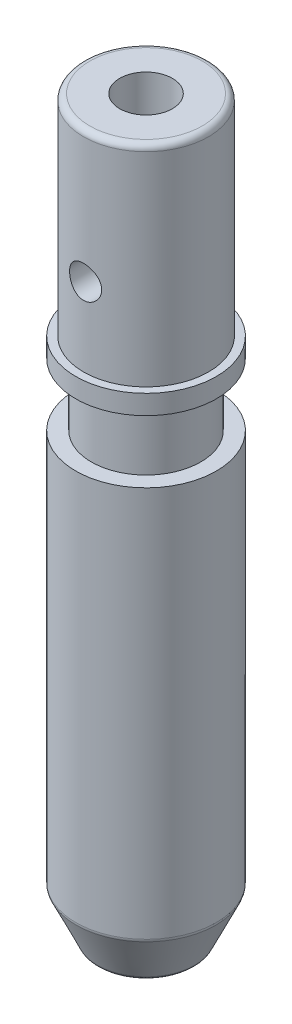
ISO-10303-21;
HEADER;
FILE_DESCRIPTION(('STEP AP214'),'2;1');
FILE_NAME('part.step','',(''),(''),'','','');
FILE_SCHEMA(('AUTOMOTIVE_DESIGN { 1 0 10303 214 1 1 1 1 }'));
ENDSEC;
DATA;
#1=APPLICATION_CONTEXT('core data for automotive mechanical design processes');
#2=APPLICATION_PROTOCOL_DEFINITION('international standard','automotive_design',2000,#1);
#3=PRODUCT_CONTEXT('',#1,'mechanical');
#4=PRODUCT('Part','Part','',(#3));
#5=PRODUCT_RELATED_PRODUCT_CATEGORY('part','',(#4));
#6=PRODUCT_DEFINITION_FORMATION('','',#4);
#7=PRODUCT_DEFINITION_CONTEXT('part definition',#1,'design');
#8=PRODUCT_DEFINITION('design','',#6,#7);
#9=PRODUCT_DEFINITION_SHAPE('','',#8);
#10=(LENGTH_UNIT() NAMED_UNIT(*) SI_UNIT(.MILLI.,.METRE.));
#11=(NAMED_UNIT(*) PLANE_ANGLE_UNIT() SI_UNIT($,.RADIAN.));
#12=(NAMED_UNIT(*) SI_UNIT($,.STERADIAN.) SOLID_ANGLE_UNIT());
#13=UNCERTAINTY_MEASURE_WITH_UNIT(LENGTH_MEASURE(1.E-05),#10,'distance_accuracy_value','');
#14=(GEOMETRIC_REPRESENTATION_CONTEXT(3) GLOBAL_UNCERTAINTY_ASSIGNED_CONTEXT((#13)) GLOBAL_UNIT_ASSIGNED_CONTEXT((#10,
#11,#12)) REPRESENTATION_CONTEXT('',''));
#15=CARTESIAN_POINT('',(0.,0.,0.));
#16=DIRECTION('',(0.,0.,1.));
#17=DIRECTION('',(1.,0.,0.));
#18=AXIS2_PLACEMENT_3D('',#15,#16,#17);
#19=CARTESIAN_POINT('',(0.,-46.609,0.));
#20=DIRECTION('',(0.,-1.,0.));
#21=DIRECTION('',(0.,0.,-1.));
#22=AXIS2_PLACEMENT_3D('',#19,#20,#21);
#23=PLANE('',#22);
#24=CARTESIAN_POINT('',(0.,-46.609,0.));
#25=DIRECTION('',(0.,-1.,0.));
#26=DIRECTION('',(0.,0.,-1.));
#27=AXIS2_PLACEMENT_3D('',#24,#25,#26);
#28=CIRCLE('',#27,14.2875);
#29=CARTESIAN_POINT('',(0.,-46.609,-14.2875));
#30=VERTEX_POINT('',#29);
#31=EDGE_CURVE('E76',#30,#30,#28,.T.);
#32=ORIENTED_EDGE('',*,*,#31,.T.);
#33=EDGE_LOOP('',(#32));
#34=FACE_BOUND('',#33,.T.);
#35=CARTESIAN_POINT('',(0.,-46.609,0.));
#36=DIRECTION('',(0.,-1.,0.));
#37=DIRECTION('',(0.,0.,-1.));
#38=AXIS2_PLACEMENT_3D('',#35,#36,#37);
#39=CIRCLE('',#38,11.1125);
#40=CARTESIAN_POINT('',(0.,-46.609,-11.1125));
#41=VERTEX_POINT('',#40);
#42=EDGE_CURVE('E63',#41,#41,#39,.T.);
#43=ORIENTED_EDGE('',*,*,#42,.F.);
#44=EDGE_LOOP('',(#43));
#45=FACE_BOUND('',#44,.T.);
#46=ADVANCED_FACE('F39',(#34,#45),#23,.T.);
#47=CARTESIAN_POINT('',(0.,-42.672,0.));
#48=DIRECTION('',(0.,1.,0.));
#49=DIRECTION('',(0.,0.,1.));
#50=AXIS2_PLACEMENT_3D('',#47,#48,#49);
#51=CYLINDRICAL_SURFACE('',#50,12.7);
#52=CARTESIAN_POINT('',(0.,-1.27,0.));
#53=DIRECTION('',(0.,1.,0.));
#54=DIRECTION('',(0.,0.,1.));
#55=AXIS2_PLACEMENT_3D('',#52,#53,#54);
#56=CIRCLE('',#55,12.7);
#57=CARTESIAN_POINT('',(0.,-1.27,12.7));
#58=VERTEX_POINT('',#57);
#59=EDGE_CURVE('E188',#58,#58,#56,.F.);
#60=ORIENTED_EDGE('',*,*,#59,.T.);
#61=EDGE_LOOP('',(#60));
#62=FACE_BOUND('',#61,.T.);
#63=CARTESIAN_POINT('',(0.,-30.0609,12.7));
#64=CARTESIAN_POINT('',(0.180166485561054,-30.0608952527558,12.6999970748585));
#65=CARTESIAN_POINT('',(0.360385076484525,-30.0459321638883,12.6961281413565));
#66=CARTESIAN_POINT('',(0.715646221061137,-29.9865715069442,12.6810694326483));
#67=CARTESIAN_POINT('',(0.890685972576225,-29.9421582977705,12.6698757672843));
#68=CARTESIAN_POINT('',(1.23040876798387,-29.825424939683,12.6414054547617));
#69=CARTESIAN_POINT('',(1.39510433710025,-29.7531393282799,12.6241363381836));
#70=CARTESIAN_POINT('',(1.71003287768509,-29.5828373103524,12.5853484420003));
#71=CARTESIAN_POINT('',(1.86026516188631,-29.4848196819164,12.5638294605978));
#72=CARTESIAN_POINT('',(2.14525801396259,-29.2635928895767,12.5183513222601));
#73=CARTESIAN_POINT('',(2.27966051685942,-29.1399305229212,12.494352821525));
#74=CARTESIAN_POINT('',(2.52606492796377,-28.8718942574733,12.4468781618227));
#75=CARTESIAN_POINT('',(2.63806416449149,-28.7275178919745,12.4234020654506));
#76=CARTESIAN_POINT('',(2.83819226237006,-28.4193396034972,12.37923124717));
#77=CARTESIAN_POINT('',(2.92591588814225,-28.2552667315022,12.3585863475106));
#78=CARTESIAN_POINT('',(3.07239491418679,-27.9140857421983,12.322991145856));
#79=CARTESIAN_POINT('',(3.13115523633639,-27.7369798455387,12.3080398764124));
#80=CARTESIAN_POINT('',(3.2168090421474,-27.3787092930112,12.2859299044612));
#81=CARTESIAN_POINT('',(3.24434857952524,-27.1977090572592,12.2786134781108));
#82=CARTESIAN_POINT('',(3.26879218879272,-26.8335210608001,12.272129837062));
#83=CARTESIAN_POINT('',(3.26570154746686,-26.6503336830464,12.272961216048));
#84=CARTESIAN_POINT('',(3.22948693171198,-26.291960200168,12.2825377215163));
#85=CARTESIAN_POINT('',(3.19713767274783,-26.1166894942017,12.2910787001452));
#86=CARTESIAN_POINT('',(3.10456198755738,-25.7741504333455,12.3147860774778));
#87=CARTESIAN_POINT('',(3.04433347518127,-25.6068826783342,12.3299529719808));
#88=CARTESIAN_POINT('',(2.89706074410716,-25.2830442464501,12.3653873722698));
#89=CARTESIAN_POINT('',(2.80973932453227,-25.1266055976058,12.3857071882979));
#90=CARTESIAN_POINT('',(2.61095317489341,-24.8303261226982,12.4291289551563));
#91=CARTESIAN_POINT('',(2.49948400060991,-24.690488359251,12.4522314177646));
#92=CARTESIAN_POINT('',(2.25157494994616,-24.4269459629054,12.4994709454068));
#93=CARTESIAN_POINT('',(2.11448261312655,-24.3038561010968,12.5236181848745));
#94=CARTESIAN_POINT('',(1.82130992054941,-24.0822930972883,12.569598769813));
#95=CARTESIAN_POINT('',(1.66522891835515,-23.9838207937,12.5914320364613));
#96=CARTESIAN_POINT('',(1.33760144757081,-23.8140440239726,12.6304435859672));
#97=CARTESIAN_POINT('',(1.16599851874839,-23.7428441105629,12.6476038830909));
#98=CARTESIAN_POINT('',(0.81271866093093,-23.6304765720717,12.6752055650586));
#99=CARTESIAN_POINT('',(0.63104377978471,-23.5893028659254,12.6856483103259));
#100=CARTESIAN_POINT('',(0.268029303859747,-23.5391062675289,12.698435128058));
#101=CARTESIAN_POINT('',(0.0868126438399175,-23.5292467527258,12.7009898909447));
#102=CARTESIAN_POINT('',(-0.274682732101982,-23.5396572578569,12.6983153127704));
#103=CARTESIAN_POINT('',(-0.454961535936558,-23.5599244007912,12.6930867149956));
#104=CARTESIAN_POINT('',(-0.80652399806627,-23.6293246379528,12.6755683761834));
#105=CARTESIAN_POINT('',(-0.977904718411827,-23.6779970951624,12.6633913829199));
#106=CARTESIAN_POINT('',(-1.31005673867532,-23.8022965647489,12.6333521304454));
#107=CARTESIAN_POINT('',(-1.47082693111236,-23.877926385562,12.6154892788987));
#108=CARTESIAN_POINT('',(-1.78049080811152,-24.0555863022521,12.5755595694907));
#109=CARTESIAN_POINT('',(-1.92910936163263,-24.158079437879,12.5534209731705));
#110=CARTESIAN_POINT('',(-2.20733354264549,-24.3859687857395,12.5075015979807));
#111=CARTESIAN_POINT('',(-2.33693568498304,-24.511369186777,12.4837205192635));
#112=CARTESIAN_POINT('',(-2.57692815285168,-24.785406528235,12.4364310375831));
#113=CARTESIAN_POINT('',(-2.68673012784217,-24.9345636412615,12.4129458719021));
#114=CARTESIAN_POINT('',(-2.8797504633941,-25.24967585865,12.3695942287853));
#115=CARTESIAN_POINT('',(-2.96296998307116,-25.4156302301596,12.3497275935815));
#116=CARTESIAN_POINT('',(-3.09983842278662,-25.7587564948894,12.3160858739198));
#117=CARTESIAN_POINT('',(-3.15366170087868,-25.9358551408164,12.3022749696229));
#118=CARTESIAN_POINT('',(-3.23065172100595,-26.2970001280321,12.2822840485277));
#119=CARTESIAN_POINT('',(-3.25382562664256,-26.4810448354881,12.2761022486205));
#120=CARTESIAN_POINT('',(-3.26846895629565,-26.8448557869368,12.2722108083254));
#121=CARTESIAN_POINT('',(-3.26088085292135,-27.0245819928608,12.2742493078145));
#122=CARTESIAN_POINT('',(-3.21638462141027,-27.3800997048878,12.2859834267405));
#123=CARTESIAN_POINT('',(-3.17947714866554,-27.5558912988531,12.2956788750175));
#124=CARTESIAN_POINT('',(-3.07791790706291,-27.8974583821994,12.3214900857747));
#125=CARTESIAN_POINT('',(-3.01345238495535,-28.0632927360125,12.3375626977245));
#126=CARTESIAN_POINT('',(-2.85875297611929,-28.381913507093,12.3743211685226));
#127=CARTESIAN_POINT('',(-2.76851531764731,-28.5346980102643,12.3950077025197));
#128=CARTESIAN_POINT('',(-2.56191914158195,-28.8274135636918,12.4393732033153));
#129=CARTESIAN_POINT('',(-2.44491110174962,-28.9668761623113,12.4631187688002));
#130=CARTESIAN_POINT('',(-2.18934878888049,-29.2244935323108,12.5105400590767));
#131=CARTESIAN_POINT('',(-2.05078935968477,-29.3426431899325,12.5342157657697));
#132=CARTESIAN_POINT('',(-1.75280657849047,-29.5565281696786,12.5793794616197));
#133=CARTESIAN_POINT('',(-1.59302999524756,-29.6517831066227,12.6008159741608));
#134=CARTESIAN_POINT('',(-1.25919082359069,-29.8139295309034,12.6385349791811));
#135=CARTESIAN_POINT('',(-1.08513813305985,-29.8808404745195,12.6548210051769));
#136=CARTESIAN_POINT('',(-0.759608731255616,-29.9749615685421,12.6781200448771));
#137=CARTESIAN_POINT('',(-0.609623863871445,-30.0071167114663,12.6862672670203));
#138=CARTESIAN_POINT('',(-0.306438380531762,-30.0500870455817,12.6972082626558));
#139=CARTESIAN_POINT('',(-0.153238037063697,-30.0609040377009,12.7000024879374));
#140=CARTESIAN_POINT('',(0.,-30.0609,12.7));
#141=B_SPLINE_CURVE_WITH_KNOTS('',3,(#63,#64,#65,#66,#67,#68,#69,#70,#71,#72,#73,#74,#75,#76,
#77,#78,#79,#80,#81,#82,#83,#84,#85,#86,#87,#88,#89,#90,#91,#92,#93,#94,#95,#96,#97,#98,#99,
#100,#101,#102,#103,#104,#105,#106,#107,#108,#109,#110,#111,#112,#113,#114,#115,#116,#117,#118,
#119,#120,#121,#122,#123,#124,#125,#126,#127,#128,#129,#130,#131,#132,#133,#134,#135,#136,#137,
#138,#139,#140),.UNSPECIFIED.,.T.,.F.,(4,2,2,2,2,2,2,2,2,2,2,2,2,2,2,2,2,2,2,2,2,2,2,2,2,2,2,2,
2,2,2,2,2,2,2,2,2,2,4),(0.,0.539937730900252,1.08016245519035,1.61971991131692,2.15930299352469,
2.70938873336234,3.25954003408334,3.81838621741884,4.37713740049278,4.92410227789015,
5.4709727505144,6.00377384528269,6.53661481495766,7.07509809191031,7.61368055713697,
8.16852849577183,8.72339532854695,9.28036852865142,9.83722889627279,10.3790807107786,
10.9208807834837,11.4541296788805,11.9874341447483,12.5306164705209,13.0738982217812,
13.6313310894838,14.1887396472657,14.7428051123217,15.2967410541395,15.8338360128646,
16.3709189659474,16.9044281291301,17.4380154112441,17.9862622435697,18.5346404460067,
19.0936791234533,19.6523334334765,20.1116085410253,20.5708448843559),.UNSPECIFIED.);
#142=CARTESIAN_POINT('',(0.,-30.0609,12.7));
#143=VERTEX_POINT('',#142);
#144=EDGE_CURVE('E84',#143,#143,#141,.T.);
#145=ORIENTED_EDGE('',*,*,#144,.F.);
#146=EDGE_LOOP('',(#145));
#147=FACE_BOUND('',#146,.T.);
#148=CARTESIAN_POINT('',(0.,-42.672,0.));
#149=DIRECTION('',(0.,-1.,0.));
#150=DIRECTION('',(0.,0.,-1.));
#151=AXIS2_PLACEMENT_3D('',#148,#149,#150);
#152=CIRCLE('',#151,12.7);
#153=CARTESIAN_POINT('',(0.,-42.672,-12.7));
#154=VERTEX_POINT('',#153);
#155=EDGE_CURVE('E79',#154,#154,#152,.F.);
#156=ORIENTED_EDGE('',*,*,#155,.T.);
#157=EDGE_LOOP('',(#156));
#158=FACE_BOUND('',#157,.T.);
#159=ADVANCED_FACE('F93',(#62,#147,#158),#51,.T.);
#160=CARTESIAN_POINT('',(0.,0.,0.));
#161=DIRECTION('',(0.,1.,0.));
#162=DIRECTION('',(0.,0.,1.));
#163=AXIS2_PLACEMENT_3D('',#160,#161,#162);
#164=PLANE('',#163);
#165=CARTESIAN_POINT('',(0.,0.,0.));
#166=DIRECTION('',(0.,1.,0.));
#167=DIRECTION('',(0.,0.,1.));
#168=AXIS2_PLACEMENT_3D('',#165,#166,#167);
#169=CIRCLE('',#168,11.43);
#170=CARTESIAN_POINT('',(0.,0.,11.43));
#171=VERTEX_POINT('',#170);
#172=EDGE_CURVE('E91',#171,#171,#169,.T.);
#173=ORIENTED_EDGE('',*,*,#172,.T.);
#174=EDGE_LOOP('',(#173));
#175=FACE_BOUND('',#174,.T.);
#176=CARTESIAN_POINT('',(0.,0.,0.));
#177=DIRECTION('',(0.,1.,0.));
#178=DIRECTION('',(0.,0.,1.));
#179=AXIS2_PLACEMENT_3D('',#176,#177,#178);
#180=CIRCLE('',#179,5.35813);
#181=CARTESIAN_POINT('',(0.,0.,5.35813));
#182=VERTEX_POINT('',#181);
#183=EDGE_CURVE('E60',#182,#182,#180,.T.);
#184=ORIENTED_EDGE('',*,*,#183,.F.);
#185=EDGE_LOOP('',(#184));
#186=FACE_BOUND('',#185,.T.);
#187=ADVANCED_FACE('F115',(#175,#186),#164,.T.);
#188=CARTESIAN_POINT('',(0.,-46.609,0.));
#189=DIRECTION('',(0.,1.,0.));
#190=DIRECTION('',(0.,0.,1.));
#191=AXIS2_PLACEMENT_3D('',#188,#189,#190);
#192=CYLINDRICAL_SURFACE('',#191,14.2875);
#193=ORIENTED_EDGE('',*,*,#31,.F.);
#194=EDGE_LOOP('',(#193));
#195=FACE_BOUND('',#194,.T.);
#196=CARTESIAN_POINT('',(0.,-42.672,0.));
#197=DIRECTION('',(0.,-1.,0.));
#198=DIRECTION('',(0.,0.,-1.));
#199=AXIS2_PLACEMENT_3D('',#196,#197,#198);
#200=CIRCLE('',#199,14.2875);
#201=CARTESIAN_POINT('',(0.,-42.672,-14.2875));
#202=VERTEX_POINT('',#201);
#203=EDGE_CURVE('E73',#202,#202,#200,.T.);
#204=ORIENTED_EDGE('',*,*,#203,.T.);
#205=EDGE_LOOP('',(#204));
#206=FACE_BOUND('',#205,.T.);
#207=ADVANCED_FACE('F117',(#195,#206),#192,.T.);
#208=CARTESIAN_POINT('',(0.,-42.672,0.));
#209=DIRECTION('',(0.,-1.,0.));
#210=DIRECTION('',(0.,0.,-1.));
#211=AXIS2_PLACEMENT_3D('',#208,#209,#210);
#212=PLANE('',#211);
#213=ORIENTED_EDGE('',*,*,#155,.F.);
#214=EDGE_LOOP('',(#213));
#215=FACE_BOUND('',#214,.T.);
#216=ORIENTED_EDGE('',*,*,#203,.F.);
#217=EDGE_LOOP('',(#216));
#218=FACE_BOUND('',#217,.T.);
#219=ADVANCED_FACE('F123',(#215,#218),#212,.F.);
#220=CARTESIAN_POINT('',(0.,-59.309,0.));
#221=DIRECTION('',(0.,1.,0.));
#222=DIRECTION('',(0.,0.,1.));
#223=AXIS2_PLACEMENT_3D('',#220,#221,#222);
#224=CYLINDRICAL_SURFACE('',#223,11.1125);
#225=CARTESIAN_POINT('',(0.,-59.309,0.));
#226=DIRECTION('',(0.,-1.,0.));
#227=DIRECTION('',(0.,0.,-1.));
#228=AXIS2_PLACEMENT_3D('',#225,#226,#227);
#229=CIRCLE('',#228,11.1125);
#230=CARTESIAN_POINT('',(0.,-59.309,-11.1125));
#231=VERTEX_POINT('',#230);
#232=EDGE_CURVE('E70',#231,#231,#229,.T.);
#233=ORIENTED_EDGE('',*,*,#232,.F.);
#234=EDGE_LOOP('',(#233));
#235=FACE_BOUND('',#234,.T.);
#236=ORIENTED_EDGE('',*,*,#42,.T.);
#237=EDGE_LOOP('',(#236));
#238=FACE_BOUND('',#237,.T.);
#239=ADVANCED_FACE('F136',(#235,#238),#224,.T.);
#240=CARTESIAN_POINT('',(0.,-59.309,0.));
#241=DIRECTION('',(0.,-1.,0.));
#242=DIRECTION('',(0.,0.,-1.));
#243=AXIS2_PLACEMENT_3D('',#240,#241,#242);
#244=PLANE('',#243);
#245=CARTESIAN_POINT('',(0.,-59.309,0.));
#246=DIRECTION('',(0.,-1.,0.));
#247=DIRECTION('',(0.,0.,-1.));
#248=AXIS2_PLACEMENT_3D('',#245,#246,#247);
#249=CIRCLE('',#248,14.2875);
#250=CARTESIAN_POINT('',(0.,-59.309,-14.2875));
#251=VERTEX_POINT('',#250);
#252=EDGE_CURVE('E59',#251,#251,#249,.T.);
#253=ORIENTED_EDGE('',*,*,#252,.F.);
#254=EDGE_LOOP('',(#253));
#255=FACE_BOUND('',#254,.T.);
#256=ORIENTED_EDGE('',*,*,#232,.T.);
#257=EDGE_LOOP('',(#256));
#258=FACE_BOUND('',#257,.T.);
#259=ADVANCED_FACE('F143',(#255,#258),#244,.F.);
#260=CARTESIAN_POINT('',(0.,-149.225,0.));
#261=DIRECTION('',(0.,1.,0.));
#262=DIRECTION('',(0.,0.,1.));
#263=AXIS2_PLACEMENT_3D('',#260,#261,#262);
#264=CYLINDRICAL_SURFACE('',#263,14.2875);
#265=CARTESIAN_POINT('',(0.,-138.783447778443,0.));
#266=DIRECTION('',(0.,-1.,0.));
#267=DIRECTION('',(0.,0.,-1.));
#268=AXIS2_PLACEMENT_3D('',#265,#266,#267);
#269=CIRCLE('',#268,14.2875);
#270=CARTESIAN_POINT('',(0.,-138.783447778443,-14.2875));
#271=VERTEX_POINT('',#270);
#272=EDGE_CURVE('E184',#271,#271,#269,.F.);
#273=ORIENTED_EDGE('',*,*,#272,.T.);
#274=EDGE_LOOP('',(#273));
#275=FACE_BOUND('',#274,.T.);
#276=ORIENTED_EDGE('',*,*,#252,.T.);
#277=EDGE_LOOP('',(#276));
#278=FACE_BOUND('',#277,.T.);
#279=ADVANCED_FACE('F153',(#275,#278),#264,.T.);
#280=CARTESIAN_POINT('',(0.,-149.225,0.));
#281=DIRECTION('',(0.,-1.,0.));
#282=DIRECTION('',(0.,0.,-1.));
#283=AXIS2_PLACEMENT_3D('',#280,#281,#282);
#284=PLANE('',#283);
#285=CARTESIAN_POINT('',(0.,-149.225,0.));
#286=DIRECTION('',(0.,-1.,0.));
#287=DIRECTION('',(0.,0.,-1.));
#288=AXIS2_PLACEMENT_3D('',#285,#286,#287);
#289=CIRCLE('',#288,8.7407349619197);
#290=CARTESIAN_POINT('',(0.,-149.225,-8.7407349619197));
#291=VERTEX_POINT('',#290);
#292=EDGE_CURVE('E11',#291,#291,#289,.T.);
#293=ORIENTED_EDGE('',*,*,#292,.T.);
#294=EDGE_LOOP('',(#293));
#295=FACE_BOUND('',#294,.T.);
#296=ADVANCED_FACE('F53',(#295),#284,.T.);
#297=CARTESIAN_POINT('',(0.,-35.179,0.));
#298=DIRECTION('',(0.,1.,0.));
#299=DIRECTION('',(0.,0.,1.));
#300=AXIS2_PLACEMENT_3D('',#297,#298,#299);
#301=CONICAL_SURFACE('',#300,5.35812999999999,1.02974425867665);
#302=CARTESIAN_POINT('',(0.,-38.3984893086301,0.));
#303=VERTEX_POINT('',#302);
#304=VERTEX_LOOP('',#303);
#305=FACE_BOUND('',#304,.T.);
#306=CARTESIAN_POINT('',(0.,-35.179,0.));
#307=DIRECTION('',(0.,1.,0.));
#308=DIRECTION('',(0.,0.,1.));
#309=AXIS2_PLACEMENT_3D('',#306,#307,#308);
#310=CIRCLE('',#309,5.35812999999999);
#311=CARTESIAN_POINT('',(0.,-35.179,5.35812999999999));
#312=VERTEX_POINT('',#311);
#313=EDGE_CURVE('E57',#312,#312,#310,.T.);
#314=ORIENTED_EDGE('',*,*,#313,.T.);
#315=EDGE_LOOP('',(#314));
#316=FACE_BOUND('',#315,.T.);
#317=ADVANCED_FACE('F49',(#305,#316),#301,.F.);
#318=CARTESIAN_POINT('',(0.,0.,0.));
#319=DIRECTION('',(0.,1.,0.));
#320=DIRECTION('',(0.,0.,1.));
#321=AXIS2_PLACEMENT_3D('',#318,#319,#320);
#322=CYLINDRICAL_SURFACE('',#321,5.35813);
#323=CARTESIAN_POINT('',(0.,-30.0609,5.35813));
#324=CARTESIAN_POINT('',(0.0833158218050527,-30.0608993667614,5.35812940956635));
#325=CARTESIAN_POINT('',(0.166646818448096,-30.057704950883,5.35618186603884));
#326=CARTESIAN_POINT('',(0.332675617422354,-30.0449700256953,5.34843888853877));
#327=CARTESIAN_POINT('',(0.415373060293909,-30.0354261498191,5.34264141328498));
#328=CARTESIAN_POINT('',(0.579608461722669,-30.0100996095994,5.32732766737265));
#329=CARTESIAN_POINT('',(0.661144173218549,-29.9943062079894,5.31780499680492));
#330=CARTESIAN_POINT('',(0.822334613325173,-29.9566949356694,5.29527745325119));
#331=CARTESIAN_POINT('',(0.901988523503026,-29.9348744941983,5.28227109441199));
#332=CARTESIAN_POINT('',(1.13646829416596,-29.8610139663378,5.23861564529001));
#333=CARTESIAN_POINT('',(1.28781956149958,-29.800415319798,5.20323071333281));
#334=CARTESIAN_POINT('',(1.57763072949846,-29.6588525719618,5.12282482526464));
#335=CARTESIAN_POINT('',(1.71609316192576,-29.5778924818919,5.07780576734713));
#336=CARTESIAN_POINT('',(1.98848544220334,-29.390902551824,4.97776183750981));
#337=CARTESIAN_POINT('',(2.12122610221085,-29.2834130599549,4.92223118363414));
#338=CARTESIAN_POINT('',(2.36794975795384,-29.0497295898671,4.80841774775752));
#339=CARTESIAN_POINT('',(2.48190786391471,-28.9235112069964,4.75013144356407));
#340=CARTESIAN_POINT('',(2.70256767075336,-28.6370815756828,4.62854974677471));
#341=CARTESIAN_POINT('',(2.80650078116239,-28.4745885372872,4.56556073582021));
#342=CARTESIAN_POINT('',(2.98522265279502,-28.1307422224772,4.45076711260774));
#343=CARTESIAN_POINT('',(3.06005950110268,-27.9494206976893,4.39894411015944));
#344=CARTESIAN_POINT('',(3.16222039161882,-27.6188646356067,4.32583468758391));
#345=CARTESIAN_POINT('',(3.19672479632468,-27.4728242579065,4.30016253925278));
#346=CARTESIAN_POINT('',(3.24534427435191,-27.1756514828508,4.26359682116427));
#347=CARTESIAN_POINT('',(3.2594859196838,-27.0245259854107,4.25268399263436));
#348=CARTESIAN_POINT('',(3.26655187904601,-26.7211433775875,4.2472606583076));
#349=CARTESIAN_POINT('',(3.2594297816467,-26.5688845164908,4.25278603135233));
#350=CARTESIAN_POINT('',(3.22433285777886,-26.2681511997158,4.27944992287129));
#351=CARTESIAN_POINT('',(3.19634194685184,-26.1196797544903,4.30060048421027));
#352=CARTESIAN_POINT('',(3.12165940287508,-25.8326635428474,4.35509643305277));
#353=CARTESIAN_POINT('',(3.07528048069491,-25.6939963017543,4.38823712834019));
#354=CARTESIAN_POINT('',(2.9655676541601,-25.426074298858,4.4631120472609));
#355=CARTESIAN_POINT('',(2.90222762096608,-25.2968229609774,4.50484937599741));
#356=CARTESIAN_POINT('',(2.74730547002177,-25.0267636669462,4.60125959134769));
#357=CARTESIAN_POINT('',(2.652695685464,-24.88803977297,4.6569099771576));
#358=CARTESIAN_POINT('',(2.44378234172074,-24.6269793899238,4.7698678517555));
#359=CARTESIAN_POINT('',(2.32945938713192,-24.504659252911,4.82717692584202));
#360=CARTESIAN_POINT('',(2.06410289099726,-24.2613621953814,4.94703484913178));
#361=CARTESIAN_POINT('',(1.91013926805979,-24.1432772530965,5.00909955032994));
#362=CARTESIAN_POINT('',(1.663409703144,-23.9870856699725,5.09413889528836));
#363=CARTESIAN_POINT('',(1.57849293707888,-23.9384935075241,5.12115300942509));
#364=CARTESIAN_POINT('',(1.40384103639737,-23.8487985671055,5.17175292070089));
#365=CARTESIAN_POINT('',(1.314108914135,-23.807691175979,5.19534082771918));
#366=CARTESIAN_POINT('',(1.13590925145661,-23.7357205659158,5.23709274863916));
#367=CARTESIAN_POINT('',(1.04768531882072,-23.7043926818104,5.25549630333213));
#368=CARTESIAN_POINT('',(0.868198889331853,-23.6492899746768,5.28810915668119));
#369=CARTESIAN_POINT('',(0.776938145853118,-23.6255108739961,5.30232083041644));
#370=CARTESIAN_POINT('',(0.592190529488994,-23.5858831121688,5.32611814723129));
#371=CARTESIAN_POINT('',(0.498705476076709,-23.5700281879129,5.33570744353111));
#372=CARTESIAN_POINT('',(0.31034585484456,-23.546502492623,5.34996821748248));
#373=CARTESIAN_POINT('',(0.215471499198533,-23.5388304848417,5.35464043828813));
#374=CARTESIAN_POINT('',(0.0386974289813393,-23.5323058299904,5.35861331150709));
#375=CARTESIAN_POINT('',(-0.0431486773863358,-23.53236371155,5.35857753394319));
#376=CARTESIAN_POINT('',(-0.206527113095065,-23.5386128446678,5.35477350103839));
#377=CARTESIAN_POINT('',(-0.288059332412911,-23.5448060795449,5.35100403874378));
#378=CARTESIAN_POINT('',(-0.531167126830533,-23.572497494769,5.33419884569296));
#379=CARTESIAN_POINT('',(-0.691446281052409,-23.6031005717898,5.31567034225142));
#380=CARTESIAN_POINT('',(-0.999025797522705,-23.6857828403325,5.26641586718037));
#381=CARTESIAN_POINT('',(-1.14656937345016,-23.7372030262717,5.23606517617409));
#382=CARTESIAN_POINT('',(-1.43088270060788,-23.8593880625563,5.16561589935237));
#383=CARTESIAN_POINT('',(-1.56765044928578,-23.9301564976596,5.12551550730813));
#384=CARTESIAN_POINT('',(-1.84175849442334,-24.0971250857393,5.03393135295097));
#385=CARTESIAN_POINT('',(-1.97770626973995,-24.1951941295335,4.98170046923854));
#386=CARTESIAN_POINT('',(-2.23222413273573,-24.4099524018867,4.87297935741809));
#387=CARTESIAN_POINT('',(-2.35077389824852,-24.5266630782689,4.81648426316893));
#388=CARTESIAN_POINT('',(-2.58376697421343,-24.793814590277,4.69607620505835));
#389=CARTESIAN_POINT('',(-2.69546008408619,-24.9466839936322,4.63219913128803));
#390=CARTESIAN_POINT('',(-2.89178251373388,-25.2716837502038,4.51224992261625));
#391=CARTESIAN_POINT('',(-2.97643708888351,-25.4437959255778,4.45617053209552));
#392=CARTESIAN_POINT('',(-3.1003201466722,-25.7654778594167,4.3705820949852));
#393=CARTESIAN_POINT('',(-3.14539931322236,-25.9119540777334,4.33795345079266));
#394=CARTESIAN_POINT('',(-3.21473547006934,-26.2120600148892,4.28683140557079));
#395=CARTESIAN_POINT('',(-3.23902282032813,-26.3656789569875,4.26831739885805));
#396=CARTESIAN_POINT('',(-3.26542462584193,-26.676653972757,4.24816028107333));
#397=CARTESIAN_POINT('',(-3.26744089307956,-26.834023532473,4.24659187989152));
#398=CARTESIAN_POINT('',(-3.2488958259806,-27.1466657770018,4.26079221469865));
#399=CARTESIAN_POINT('',(-3.22832354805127,-27.3019374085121,4.27656935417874));
#400=CARTESIAN_POINT('',(-3.16779145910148,-27.5966563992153,4.32156722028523));
#401=CARTESIAN_POINT('',(-3.12905673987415,-27.7364957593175,4.34993310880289));
#402=CARTESIAN_POINT('',(-3.03443918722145,-28.0077346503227,4.41645419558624));
#403=CARTESIAN_POINT('',(-2.97854976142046,-28.1391309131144,4.45461315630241));
#404=CARTESIAN_POINT('',(-2.84152460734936,-28.4111114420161,4.54344714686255));
#405=CARTESIAN_POINT('',(-2.75784852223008,-28.5500779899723,4.59514233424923));
#406=CARTESIAN_POINT('',(-2.57163475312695,-28.8133756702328,4.70189140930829));
#407=CARTESIAN_POINT('',(-2.4690814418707,-28.9376945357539,4.75694805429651));
#408=CARTESIAN_POINT('',(-2.22690758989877,-29.190692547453,4.8756212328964));
#409=CARTESIAN_POINT('',(-2.08393983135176,-29.3162850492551,4.93903800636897));
#410=CARTESIAN_POINT('',(-1.77590183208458,-29.5421042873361,5.05795407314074));
#411=CARTESIAN_POINT('',(-1.61082180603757,-29.642319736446,5.1134498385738));
#412=CARTESIAN_POINT('',(-1.35124664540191,-29.7695850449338,5.18571222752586));
#413=CARTESIAN_POINT('',(-1.26360908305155,-29.807907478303,5.20781113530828));
#414=CARTESIAN_POINT('',(-1.08452538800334,-29.8769411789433,5.24802421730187));
#415=CARTESIAN_POINT('',(-0.993081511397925,-29.9076568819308,5.26614071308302));
#416=CARTESIAN_POINT('',(-0.807371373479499,-29.9609381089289,5.29778837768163));
#417=CARTESIAN_POINT('',(-0.713113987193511,-29.9835268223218,5.31133258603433));
#418=CARTESIAN_POINT('',(-0.522450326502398,-30.020274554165,5.33346000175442));
#419=CARTESIAN_POINT('',(-0.426045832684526,-30.034440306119,5.34204717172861));
#420=CARTESIAN_POINT('',(-0.27447586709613,-30.0498022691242,5.35137550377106));
#421=CARTESIAN_POINT('',(-0.219699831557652,-30.0539609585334,5.35390549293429));
#422=CARTESIAN_POINT('',(-0.109951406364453,-30.0595101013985,5.35728297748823));
#423=CARTESIAN_POINT('',(-0.0549790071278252,-30.0609004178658,5.35813038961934));
#424=CARTESIAN_POINT('',(0.,-30.0609,5.35813));
#425=B_SPLINE_CURVE_WITH_KNOTS('',3,(#323,#324,#325,#326,#327,#328,#329,#330,#331,#332,#333,
#334,#335,#336,#337,#338,#339,#340,#341,#342,#343,#344,#345,#346,#347,#348,#349,#350,#351,#352,
#353,#354,#355,#356,#357,#358,#359,#360,#361,#362,#363,#364,#365,#366,#367,#368,#369,#370,#371,
#372,#373,#374,#375,#376,#377,#378,#379,#380,#381,#382,#383,#384,#385,#386,#387,#388,#389,#390,
#391,#392,#393,#394,#395,#396,#397,#398,#399,#400,#401,#402,#403,#404,#405,#406,#407,#408,#409,
#410,#411,#412,#413,#414,#415,#416,#417,#418,#419,#420,#421,#422,#423,#424),.UNSPECIFIED.,.T.,
.F.,(4,2,2,2,2,2,2,2,2,2,2,2,2,2,2,2,2,2,2,2,2,2,2,2,2,2,2,2,2,2,2,2,2,2,2,2,2,2,2,2,2,2,2,2,2,
2,2,2,2,2,4),(0.,0.249889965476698,0.499912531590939,0.750366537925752,1.00092753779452,
1.49901474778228,1.99700391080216,2.53370724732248,3.07111617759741,3.67690949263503,
4.28169731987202,4.7365005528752,5.19070975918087,5.64591107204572,6.1014635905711,
6.54958010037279,6.99785875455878,7.5265257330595,8.05571585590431,8.66342151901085,
8.96755553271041,9.27150145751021,9.55732466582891,9.84298561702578,10.1284204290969,
10.4138120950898,10.6590291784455,10.9043255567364,11.3943484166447,11.8699402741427,
12.3456203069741,12.8703044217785,13.3955966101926,13.9923144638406,14.588473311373,
15.056640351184,15.5241226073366,15.9936650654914,16.4634351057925,16.9052817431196,
17.34729839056,17.8561918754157,18.3655085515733,18.9645057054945,19.5637688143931,
19.8579075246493,20.1518743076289,20.4449955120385,20.7378820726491,20.9027729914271,
21.0676720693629),.UNSPECIFIED.);
#426=CARTESIAN_POINT('',(0.,-30.0609,5.35813));
#427=VERTEX_POINT('',#426);
#428=EDGE_CURVE('E66',#427,#427,#425,.T.);
#429=ORIENTED_EDGE('',*,*,#428,.T.);
#430=EDGE_LOOP('',(#429));
#431=FACE_BOUND('',#430,.T.);
#432=ORIENTED_EDGE('',*,*,#313,.F.);
#433=EDGE_LOOP('',(#432));
#434=FACE_BOUND('',#433,.T.);
#435=ORIENTED_EDGE('',*,*,#183,.T.);
#436=EDGE_LOOP('',(#435));
#437=FACE_BOUND('',#436,.T.);
#438=ADVANCED_FACE('F52',(#431,#434,#437),#322,.F.);
#439=CARTESIAN_POINT('',(0.,-26.797,12.7));
#440=DIRECTION('',(0.,0.,1.));
#441=DIRECTION('',(1.,0.,0.));
#442=AXIS2_PLACEMENT_3D('',#439,#440,#441);
#443=CYLINDRICAL_SURFACE('',#442,3.26389999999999);
#444=ORIENTED_EDGE('',*,*,#144,.T.);
#445=EDGE_LOOP('',(#444));
#446=FACE_BOUND('',#445,.T.);
#447=ORIENTED_EDGE('',*,*,#428,.F.);
#448=EDGE_LOOP('',(#447));
#449=FACE_BOUND('',#448,.T.);
#450=ADVANCED_FACE('F97',(#446,#449),#443,.F.);
#451=CARTESIAN_POINT('',(0.,-149.225,0.));
#452=DIRECTION('',(0.,1.,0.));
#453=DIRECTION('',(0.,0.,1.));
#454=AXIS2_PLACEMENT_3D('',#451,#452,#453);
#455=CONICAL_SURFACE('',#454,9.54981419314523,0.436332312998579);
#456=CARTESIAN_POINT('',(0.,-139.320172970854,0.));
#457=DIRECTION('',(0.,1.,0.));
#458=DIRECTION('',(0.,0.,1.));
#459=AXIS2_PLACEMENT_3D('',#456,#457,#458);
#460=CIRCLE('',#459,14.1685108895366);
#461=CARTESIAN_POINT('',(0.,-139.320172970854,14.1685108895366));
#462=VERTEX_POINT('',#461);
#463=EDGE_CURVE('E46',#462,#462,#460,.F.);
#464=ORIENTED_EDGE('',*,*,#463,.T.);
#465=EDGE_LOOP('',(#464));
#466=FACE_BOUND('',#465,.T.);
#467=CARTESIAN_POINT('',(0.,-148.491725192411,0.));
#468=DIRECTION('',(0.,-1.,0.));
#469=DIRECTION('',(0.,0.,-1.));
#470=AXIS2_PLACEMENT_3D('',#467,#468,#469);
#471=CIRCLE('',#470,9.89174585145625);
#472=CARTESIAN_POINT('',(0.,-148.491725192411,-9.89174585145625));
#473=VERTEX_POINT('',#472);
#474=EDGE_CURVE('E182',#473,#473,#471,.F.);
#475=ORIENTED_EDGE('',*,*,#474,.T.);
#476=EDGE_LOOP('',(#475));
#477=FACE_BOUND('',#476,.T.);
#478=ADVANCED_FACE('F101',(#466,#477),#455,.T.);
#479=CARTESIAN_POINT('',(0.,-1.27,0.));
#480=DIRECTION('',(0.,1.,0.));
#481=DIRECTION('',(0.,0.,1.));
#482=AXIS2_PLACEMENT_3D('',#479,#480,#481);
#483=TOROIDAL_SURFACE('',#482,11.43,1.27);
#484=ORIENTED_EDGE('',*,*,#59,.F.);
#485=EDGE_LOOP('',(#484));
#486=FACE_BOUND('',#485,.T.);
#487=ORIENTED_EDGE('',*,*,#172,.F.);
#488=EDGE_LOOP('',(#487));
#489=FACE_BOUND('',#488,.T.);
#490=ADVANCED_FACE('F178',(#486,#489),#483,.T.);
#491=CARTESIAN_POINT('',(0.,-138.783447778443,0.));
#492=DIRECTION('',(0.,-1.,0.));
#493=DIRECTION('',(0.,0.,-1.));
#494=AXIS2_PLACEMENT_3D('',#491,#492,#493);
#495=TOROIDAL_SURFACE('',#494,13.0175,1.27);
#496=ORIENTED_EDGE('',*,*,#463,.F.);
#497=EDGE_LOOP('',(#496));
#498=FACE_BOUND('',#497,.T.);
#499=ORIENTED_EDGE('',*,*,#272,.F.);
#500=EDGE_LOOP('',(#499));
#501=FACE_BOUND('',#500,.T.);
#502=ADVANCED_FACE('F173',(#498,#501),#495,.T.);
#503=CARTESIAN_POINT('',(0.,-147.955,0.));
#504=DIRECTION('',(0.,-1.,0.));
#505=DIRECTION('',(0.,0.,-1.));
#506=AXIS2_PLACEMENT_3D('',#503,#504,#505);
#507=TOROIDAL_SURFACE('',#506,8.7407349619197,1.27);
#508=ORIENTED_EDGE('',*,*,#474,.F.);
#509=EDGE_LOOP('',(#508));
#510=FACE_BOUND('',#509,.T.);
#511=ORIENTED_EDGE('',*,*,#292,.F.);
#512=EDGE_LOOP('',(#511));
#513=FACE_BOUND('',#512,.T.);
#514=ADVANCED_FACE('F41',(#510,#513),#507,.T.);
#515=CLOSED_SHELL('',(#46,#159,#187,#207,#219,#239,#259,#279,#296,#317,#438,#450,#478,#490,#502,#514));
#516=MANIFOLD_SOLID_BREP('B2',#515);
#517=ADVANCED_BREP_SHAPE_REPRESENTATION('',(#18,#516),#14);
#518=SHAPE_DEFINITION_REPRESENTATION(#9,#517);
ENDSEC;
END-ISO-10303-21;
